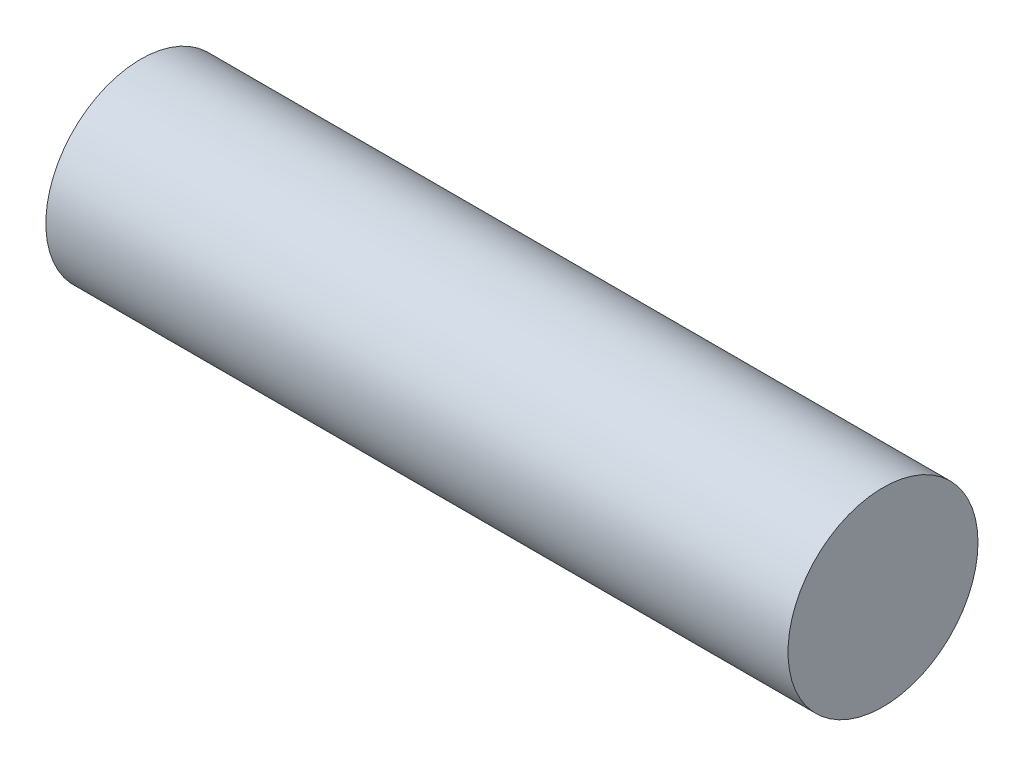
ISO-10303-21;
HEADER;
FILE_DESCRIPTION(('STEP AP214'),'2;1');
FILE_NAME('part.step','',(''),(''),'','','');
FILE_SCHEMA(('AUTOMOTIVE_DESIGN { 1 0 10303 214 1 1 1 1 }'));
ENDSEC;
DATA;
#1=APPLICATION_CONTEXT('core data for automotive mechanical design processes');
#2=APPLICATION_PROTOCOL_DEFINITION('international standard','automotive_design',2000,#1);
#3=PRODUCT_CONTEXT('',#1,'mechanical');
#4=PRODUCT('Part','Part','',(#3));
#5=PRODUCT_RELATED_PRODUCT_CATEGORY('part','',(#4));
#6=PRODUCT_DEFINITION_FORMATION('','',#4);
#7=PRODUCT_DEFINITION_CONTEXT('part definition',#1,'design');
#8=PRODUCT_DEFINITION('design','',#6,#7);
#9=PRODUCT_DEFINITION_SHAPE('','',#8);
#10=(LENGTH_UNIT() NAMED_UNIT(*) SI_UNIT(.MILLI.,.METRE.));
#11=(NAMED_UNIT(*) PLANE_ANGLE_UNIT() SI_UNIT($,.RADIAN.));
#12=(NAMED_UNIT(*) SI_UNIT($,.STERADIAN.) SOLID_ANGLE_UNIT());
#13=UNCERTAINTY_MEASURE_WITH_UNIT(LENGTH_MEASURE(1.E-05),#10,'distance_accuracy_value','');
#14=(GEOMETRIC_REPRESENTATION_CONTEXT(3) GLOBAL_UNCERTAINTY_ASSIGNED_CONTEXT((#13)) GLOBAL_UNIT_ASSIGNED_CONTEXT((#10,
#11,#12)) REPRESENTATION_CONTEXT('',''));
#15=CARTESIAN_POINT('',(0.,0.,0.));
#16=DIRECTION('',(0.,0.,1.));
#17=DIRECTION('',(1.,0.,0.));
#18=AXIS2_PLACEMENT_3D('',#15,#16,#17);
#19=CARTESIAN_POINT('',(2.54,0.,0.));
#20=DIRECTION('',(-1.,0.,0.));
#21=DIRECTION('',(0.,0.,1.));
#22=AXIS2_PLACEMENT_3D('',#19,#20,#21);
#23=CYLINDRICAL_SURFACE('',#22,0.65024);
#24=CARTESIAN_POINT('',(2.54,0.,0.));
#25=DIRECTION('',(1.,0.,0.));
#26=DIRECTION('',(0.,0.,-1.));
#27=AXIS2_PLACEMENT_3D('',#24,#25,#26);
#28=CIRCLE('',#27,0.65024);
#29=CARTESIAN_POINT('',(2.54,0.,-0.65024));
#30=VERTEX_POINT('',#29);
#31=EDGE_CURVE('E10',#30,#30,#28,.T.);
#32=ORIENTED_EDGE('',*,*,#31,.F.);
#33=EDGE_LOOP('',(#32));
#34=FACE_BOUND('',#33,.T.);
#35=CARTESIAN_POINT('',(-2.54,0.,0.));
#36=DIRECTION('',(1.,0.,0.));
#37=DIRECTION('',(0.,0.,-1.));
#38=AXIS2_PLACEMENT_3D('',#35,#36,#37);
#39=CIRCLE('',#38,0.65024);
#40=CARTESIAN_POINT('',(-2.54,0.,-0.65024));
#41=VERTEX_POINT('',#40);
#42=EDGE_CURVE('E36',#41,#41,#39,.T.);
#43=ORIENTED_EDGE('',*,*,#42,.T.);
#44=EDGE_LOOP('',(#43));
#45=FACE_BOUND('',#44,.T.);
#46=ADVANCED_FACE('F33',(#34,#45),#23,.T.);
#47=CARTESIAN_POINT('',(2.54,0.,0.));
#48=DIRECTION('',(1.,0.,0.));
#49=DIRECTION('',(0.,0.,-1.));
#50=AXIS2_PLACEMENT_3D('',#47,#48,#49);
#51=PLANE('',#50);
#52=ORIENTED_EDGE('',*,*,#31,.T.);
#53=EDGE_LOOP('',(#52));
#54=FACE_BOUND('',#53,.T.);
#55=ADVANCED_FACE('F48',(#54),#51,.T.);
#56=CARTESIAN_POINT('',(-2.54,0.,0.));
#57=DIRECTION('',(1.,0.,0.));
#58=DIRECTION('',(0.,0.,-1.));
#59=AXIS2_PLACEMENT_3D('',#56,#57,#58);
#60=PLANE('',#59);
#61=ORIENTED_EDGE('',*,*,#42,.F.);
#62=EDGE_LOOP('',(#61));
#63=FACE_BOUND('',#62,.T.);
#64=ADVANCED_FACE('F46',(#63),#60,.F.);
#65=CLOSED_SHELL('',(#46,#55,#64));
#66=MANIFOLD_SOLID_BREP('B2',#65);
#67=ADVANCED_BREP_SHAPE_REPRESENTATION('',(#18,#66),#14);
#68=SHAPE_DEFINITION_REPRESENTATION(#9,#67);
ENDSEC;
END-ISO-10303-21;
